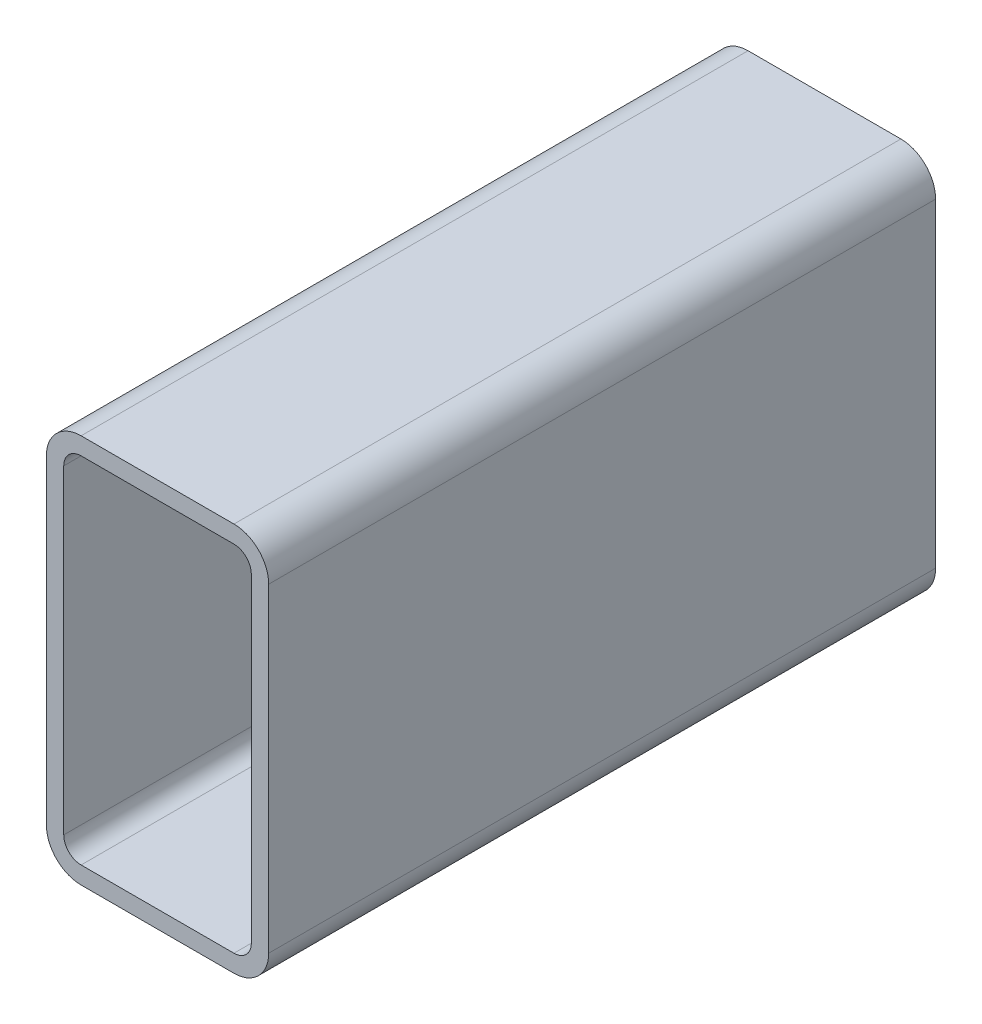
ISO-10303-21;
HEADER;
FILE_DESCRIPTION(('STEP AP214'),'2;1');
FILE_NAME('part.step','',(''),(''),'','','');
FILE_SCHEMA(('AUTOMOTIVE_DESIGN { 1 0 10303 214 1 1 1 1 }'));
ENDSEC;
DATA;
#1=APPLICATION_CONTEXT('core data for automotive mechanical design processes');
#2=APPLICATION_PROTOCOL_DEFINITION('international standard','automotive_design',2000,#1);
#3=PRODUCT_CONTEXT('',#1,'mechanical');
#4=PRODUCT('Part','Part','',(#3));
#5=PRODUCT_RELATED_PRODUCT_CATEGORY('part','',(#4));
#6=PRODUCT_DEFINITION_FORMATION('','',#4);
#7=PRODUCT_DEFINITION_CONTEXT('part definition',#1,'design');
#8=PRODUCT_DEFINITION('design','',#6,#7);
#9=PRODUCT_DEFINITION_SHAPE('','',#8);
#10=(LENGTH_UNIT() NAMED_UNIT(*) SI_UNIT(.MILLI.,.METRE.));
#11=(NAMED_UNIT(*) PLANE_ANGLE_UNIT() SI_UNIT($,.RADIAN.));
#12=(NAMED_UNIT(*) SI_UNIT($,.STERADIAN.) SOLID_ANGLE_UNIT());
#13=UNCERTAINTY_MEASURE_WITH_UNIT(LENGTH_MEASURE(1.E-05),#10,'distance_accuracy_value','');
#14=(GEOMETRIC_REPRESENTATION_CONTEXT(3) GLOBAL_UNCERTAINTY_ASSIGNED_CONTEXT((#13)) GLOBAL_UNIT_ASSIGNED_CONTEXT((#10,
#11,#12)) REPRESENTATION_CONTEXT('',''));
#15=CARTESIAN_POINT('',(0.,0.,0.));
#16=DIRECTION('',(0.,0.,1.));
#17=DIRECTION('',(1.,0.,0.));
#18=AXIS2_PLACEMENT_3D('',#15,#16,#17);
#19=CARTESIAN_POINT('',(17.5501778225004,163.914039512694,304.8));
#20=DIRECTION('',(0.,0.,1.));
#21=DIRECTION('',(1.,0.,0.));
#22=AXIS2_PLACEMENT_3D('',#19,#20,#21);
#23=PLANE('',#22);
#24=CARTESIAN_POINT('',(17.5501778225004,163.914039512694,304.8));
#25=DIRECTION('',(0.,0.,1.));
#26=DIRECTION('',(1.,0.,0.));
#27=AXIS2_PLACEMENT_3D('',#24,#25,#26);
#28=CIRCLE('',#27,15.875);
#29=CARTESIAN_POINT('',(17.5501778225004,179.789039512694,304.8));
#30=VERTEX_POINT('',#29);
#31=CARTESIAN_POINT('',(1.67517782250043,163.914039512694,304.8));
#32=VERTEX_POINT('',#31);
#33=EDGE_CURVE('E211',#30,#32,#28,.T.);
#34=ORIENTED_EDGE('',*,*,#33,.T.);
#35=DIRECTION('',(0.,-1.,0.));
#36=VECTOR('',#35,1.);
#37=CARTESIAN_POINT('',(1.67517782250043,17.8640395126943,304.8));
#38=LINE('',#37,#36);
#39=CARTESIAN_POINT('',(1.67517782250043,17.8640395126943,304.8));
#40=VERTEX_POINT('',#39);
#41=EDGE_CURVE('E214',#32,#40,#38,.T.);
#42=ORIENTED_EDGE('',*,*,#41,.T.);
#43=CARTESIAN_POINT('',(17.5501778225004,17.8640395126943,304.8));
#44=DIRECTION('',(0.,0.,1.));
#45=DIRECTION('',(1.,0.,0.));
#46=AXIS2_PLACEMENT_3D('',#43,#44,#45);
#47=CIRCLE('',#46,15.875);
#48=CARTESIAN_POINT('',(17.5501778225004,1.98903951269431,304.8));
#49=VERTEX_POINT('',#48);
#50=EDGE_CURVE('E217',#40,#49,#47,.T.);
#51=ORIENTED_EDGE('',*,*,#50,.T.);
#52=DIRECTION('',(1.,0.,0.));
#53=VECTOR('',#52,1.);
#54=CARTESIAN_POINT('',(87.4001778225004,1.98903951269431,304.8));
#55=LINE('',#54,#53);
#56=CARTESIAN_POINT('',(87.4001778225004,1.98903951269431,304.8));
#57=VERTEX_POINT('',#56);
#58=EDGE_CURVE('E219',#49,#57,#55,.T.);
#59=ORIENTED_EDGE('',*,*,#58,.T.);
#60=CARTESIAN_POINT('',(87.4001778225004,17.8640395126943,304.8));
#61=DIRECTION('',(0.,0.,1.));
#62=DIRECTION('',(1.,0.,0.));
#63=AXIS2_PLACEMENT_3D('',#60,#61,#62);
#64=CIRCLE('',#63,15.875);
#65=CARTESIAN_POINT('',(103.2751778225,17.8640395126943,304.8));
#66=VERTEX_POINT('',#65);
#67=EDGE_CURVE('E221',#57,#66,#64,.T.);
#68=ORIENTED_EDGE('',*,*,#67,.T.);
#69=DIRECTION('',(0.,1.,0.));
#70=VECTOR('',#69,1.);
#71=CARTESIAN_POINT('',(103.2751778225,163.914039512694,304.8));
#72=LINE('',#71,#70);
#73=CARTESIAN_POINT('',(103.2751778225,163.914039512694,304.8));
#74=VERTEX_POINT('',#73);
#75=EDGE_CURVE('E223',#66,#74,#72,.T.);
#76=ORIENTED_EDGE('',*,*,#75,.T.);
#77=CARTESIAN_POINT('',(87.4001778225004,163.914039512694,304.8));
#78=DIRECTION('',(0.,0.,1.));
#79=DIRECTION('',(1.,0.,0.));
#80=AXIS2_PLACEMENT_3D('',#77,#78,#79);
#81=CIRCLE('',#80,15.875);
#82=CARTESIAN_POINT('',(87.4001778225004,179.789039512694,304.8));
#83=VERTEX_POINT('',#82);
#84=EDGE_CURVE('E225',#74,#83,#81,.T.);
#85=ORIENTED_EDGE('',*,*,#84,.T.);
#86=DIRECTION('',(-1.,0.,0.));
#87=VECTOR('',#86,1.);
#88=CARTESIAN_POINT('',(17.5501778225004,179.789039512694,304.8));
#89=LINE('',#88,#87);
#90=EDGE_CURVE('E227',#83,#30,#89,.T.);
#91=ORIENTED_EDGE('',*,*,#90,.T.);
#92=EDGE_LOOP('',(#34,#42,#51,#59,#68,#76,#85,#91));
#93=FACE_BOUND('',#92,.T.);
#94=DIRECTION('',(0.,-1.,0.));
#95=VECTOR('',#94,1.);
#96=CARTESIAN_POINT('',(9.61267782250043,17.8640395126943,304.8));
#97=LINE('',#96,#95);
#98=CARTESIAN_POINT('',(9.61267782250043,163.914039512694,304.8));
#99=VERTEX_POINT('',#98);
#100=CARTESIAN_POINT('',(9.61267782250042,17.8640395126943,304.8));
#101=VERTEX_POINT('',#100);
#102=EDGE_CURVE('E154',#99,#101,#97,.T.);
#103=ORIENTED_EDGE('',*,*,#102,.F.);
#104=CARTESIAN_POINT('',(17.5501778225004,163.914039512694,304.8));
#105=DIRECTION('',(0.,0.,1.));
#106=DIRECTION('',(1.,0.,0.));
#107=AXIS2_PLACEMENT_3D('',#104,#105,#106);
#108=CIRCLE('',#107,7.93750000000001);
#109=CARTESIAN_POINT('',(17.5501778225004,171.851539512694,304.8));
#110=VERTEX_POINT('',#109);
#111=EDGE_CURVE('E146',#110,#99,#108,.T.);
#112=ORIENTED_EDGE('',*,*,#111,.F.);
#113=DIRECTION('',(-1.,0.,0.));
#114=VECTOR('',#113,1.);
#115=CARTESIAN_POINT('',(17.5501778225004,171.851539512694,304.8));
#116=LINE('',#115,#114);
#117=CARTESIAN_POINT('',(87.4001778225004,171.851539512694,304.8));
#118=VERTEX_POINT('',#117);
#119=EDGE_CURVE('E179',#118,#110,#116,.T.);
#120=ORIENTED_EDGE('',*,*,#119,.F.);
#121=CARTESIAN_POINT('',(87.4001778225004,163.914039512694,304.8));
#122=DIRECTION('',(0.,0.,1.));
#123=DIRECTION('',(1.,0.,0.));
#124=AXIS2_PLACEMENT_3D('',#121,#122,#123);
#125=CIRCLE('',#124,7.93750000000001);
#126=CARTESIAN_POINT('',(95.3376778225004,163.914039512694,304.8));
#127=VERTEX_POINT('',#126);
#128=EDGE_CURVE('E177',#127,#118,#125,.T.);
#129=ORIENTED_EDGE('',*,*,#128,.F.);
#130=DIRECTION('',(0.,1.,0.));
#131=VECTOR('',#130,1.);
#132=CARTESIAN_POINT('',(95.3376778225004,163.914039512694,304.8));
#133=LINE('',#132,#131);
#134=CARTESIAN_POINT('',(95.3376778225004,17.8640395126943,304.8));
#135=VERTEX_POINT('',#134);
#136=EDGE_CURVE('E175',#135,#127,#133,.T.);
#137=ORIENTED_EDGE('',*,*,#136,.F.);
#138=CARTESIAN_POINT('',(87.4001778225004,17.8640395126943,304.8));
#139=DIRECTION('',(0.,0.,1.));
#140=DIRECTION('',(1.,0.,0.));
#141=AXIS2_PLACEMENT_3D('',#138,#139,#140);
#142=CIRCLE('',#141,7.9375);
#143=CARTESIAN_POINT('',(87.4001778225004,9.92653951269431,304.8));
#144=VERTEX_POINT('',#143);
#145=EDGE_CURVE('E173',#144,#135,#142,.T.);
#146=ORIENTED_EDGE('',*,*,#145,.F.);
#147=DIRECTION('',(1.,0.,0.));
#148=VECTOR('',#147,1.);
#149=CARTESIAN_POINT('',(87.4001778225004,9.92653951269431,304.8));
#150=LINE('',#149,#148);
#151=CARTESIAN_POINT('',(17.5501778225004,9.92653951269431,304.8));
#152=VERTEX_POINT('',#151);
#153=EDGE_CURVE('E169',#152,#144,#150,.T.);
#154=ORIENTED_EDGE('',*,*,#153,.F.);
#155=CARTESIAN_POINT('',(17.5501778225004,17.8640395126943,304.8));
#156=DIRECTION('',(0.,0.,1.));
#157=DIRECTION('',(1.,0.,0.));
#158=AXIS2_PLACEMENT_3D('',#155,#156,#157);
#159=CIRCLE('',#158,7.9375);
#160=EDGE_CURVE('E167',#101,#152,#159,.T.);
#161=ORIENTED_EDGE('',*,*,#160,.F.);
#162=EDGE_LOOP('',(#103,#112,#120,#129,#137,#146,#154,#161));
#163=FACE_BOUND('',#162,.T.);
#164=ADVANCED_FACE('F33',(#93,#163),#23,.T.);
#165=CARTESIAN_POINT('',(17.5501778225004,163.914039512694,0.));
#166=DIRECTION('',(0.,0.,1.));
#167=DIRECTION('',(1.,0.,0.));
#168=AXIS2_PLACEMENT_3D('',#165,#166,#167);
#169=PLANE('',#168);
#170=CARTESIAN_POINT('',(17.5501778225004,163.914039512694,0.));
#171=DIRECTION('',(0.,0.,1.));
#172=DIRECTION('',(1.,0.,0.));
#173=AXIS2_PLACEMENT_3D('',#170,#171,#172);
#174=CIRCLE('',#173,15.875);
#175=CARTESIAN_POINT('',(17.5501778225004,179.789039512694,0.));
#176=VERTEX_POINT('',#175);
#177=CARTESIAN_POINT('',(1.67517782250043,163.914039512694,0.));
#178=VERTEX_POINT('',#177);
#179=EDGE_CURVE('E162',#176,#178,#174,.T.);
#180=ORIENTED_EDGE('',*,*,#179,.F.);
#181=DIRECTION('',(-1.,0.,0.));
#182=VECTOR('',#181,1.);
#183=CARTESIAN_POINT('',(17.5501778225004,179.789039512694,0.));
#184=LINE('',#183,#182);
#185=CARTESIAN_POINT('',(87.4001778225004,179.789039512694,0.));
#186=VERTEX_POINT('',#185);
#187=EDGE_CURVE('E215',#186,#176,#184,.T.);
#188=ORIENTED_EDGE('',*,*,#187,.F.);
#189=CARTESIAN_POINT('',(87.4001778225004,163.914039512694,0.));
#190=DIRECTION('',(0.,0.,1.));
#191=DIRECTION('',(1.,0.,0.));
#192=AXIS2_PLACEMENT_3D('',#189,#190,#191);
#193=CIRCLE('',#192,15.875);
#194=CARTESIAN_POINT('',(103.2751778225,163.914039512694,0.));
#195=VERTEX_POINT('',#194);
#196=EDGE_CURVE('E242',#195,#186,#193,.T.);
#197=ORIENTED_EDGE('',*,*,#196,.F.);
#198=DIRECTION('',(0.,1.,0.));
#199=VECTOR('',#198,1.);
#200=CARTESIAN_POINT('',(103.2751778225,163.914039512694,0.));
#201=LINE('',#200,#199);
#202=CARTESIAN_POINT('',(103.2751778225,17.8640395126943,0.));
#203=VERTEX_POINT('',#202);
#204=EDGE_CURVE('E240',#203,#195,#201,.T.);
#205=ORIENTED_EDGE('',*,*,#204,.F.);
#206=CARTESIAN_POINT('',(87.4001778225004,17.8640395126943,0.));
#207=DIRECTION('',(0.,0.,1.));
#208=DIRECTION('',(1.,0.,0.));
#209=AXIS2_PLACEMENT_3D('',#206,#207,#208);
#210=CIRCLE('',#209,15.875);
#211=CARTESIAN_POINT('',(87.4001778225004,1.98903951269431,0.));
#212=VERTEX_POINT('',#211);
#213=EDGE_CURVE('E238',#212,#203,#210,.T.);
#214=ORIENTED_EDGE('',*,*,#213,.F.);
#215=DIRECTION('',(1.,0.,0.));
#216=VECTOR('',#215,1.);
#217=CARTESIAN_POINT('',(87.4001778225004,1.98903951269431,0.));
#218=LINE('',#217,#216);
#219=CARTESIAN_POINT('',(17.5501778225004,1.98903951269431,0.));
#220=VERTEX_POINT('',#219);
#221=EDGE_CURVE('E236',#220,#212,#218,.T.);
#222=ORIENTED_EDGE('',*,*,#221,.F.);
#223=CARTESIAN_POINT('',(17.5501778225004,17.8640395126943,0.));
#224=DIRECTION('',(0.,0.,1.));
#225=DIRECTION('',(1.,0.,0.));
#226=AXIS2_PLACEMENT_3D('',#223,#224,#225);
#227=CIRCLE('',#226,15.875);
#228=CARTESIAN_POINT('',(1.67517782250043,17.8640395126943,0.));
#229=VERTEX_POINT('',#228);
#230=EDGE_CURVE('E234',#229,#220,#227,.T.);
#231=ORIENTED_EDGE('',*,*,#230,.F.);
#232=DIRECTION('',(0.,-1.,0.));
#233=VECTOR('',#232,1.);
#234=CARTESIAN_POINT('',(1.67517782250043,17.8640395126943,0.));
#235=LINE('',#234,#233);
#236=EDGE_CURVE('E232',#178,#229,#235,.T.);
#237=ORIENTED_EDGE('',*,*,#236,.F.);
#238=EDGE_LOOP('',(#180,#188,#197,#205,#214,#222,#231,#237));
#239=FACE_BOUND('',#238,.T.);
#240=CARTESIAN_POINT('',(17.5501778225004,163.914039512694,0.));
#241=DIRECTION('',(0.,0.,1.));
#242=DIRECTION('',(1.,0.,0.));
#243=AXIS2_PLACEMENT_3D('',#240,#241,#242);
#244=CIRCLE('',#243,7.93750000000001);
#245=CARTESIAN_POINT('',(17.5501778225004,171.851539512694,0.));
#246=VERTEX_POINT('',#245);
#247=CARTESIAN_POINT('',(9.61267782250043,163.914039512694,0.));
#248=VERTEX_POINT('',#247);
#249=EDGE_CURVE('E56',#246,#248,#244,.T.);
#250=ORIENTED_EDGE('',*,*,#249,.T.);
#251=DIRECTION('',(0.,-1.,0.));
#252=VECTOR('',#251,1.);
#253=CARTESIAN_POINT('',(9.61267782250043,17.8640395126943,0.));
#254=LINE('',#253,#252);
#255=CARTESIAN_POINT('',(9.61267782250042,17.8640395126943,0.));
#256=VERTEX_POINT('',#255);
#257=EDGE_CURVE('E161',#248,#256,#254,.T.);
#258=ORIENTED_EDGE('',*,*,#257,.T.);
#259=CARTESIAN_POINT('',(17.5501778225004,17.8640395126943,0.));
#260=DIRECTION('',(0.,0.,1.));
#261=DIRECTION('',(1.,0.,0.));
#262=AXIS2_PLACEMENT_3D('',#259,#260,#261);
#263=CIRCLE('',#262,7.9375);
#264=CARTESIAN_POINT('',(17.5501778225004,9.92653951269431,0.));
#265=VERTEX_POINT('',#264);
#266=EDGE_CURVE('E183',#256,#265,#263,.T.);
#267=ORIENTED_EDGE('',*,*,#266,.T.);
#268=DIRECTION('',(1.,0.,0.));
#269=VECTOR('',#268,1.);
#270=CARTESIAN_POINT('',(87.4001778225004,9.92653951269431,0.));
#271=LINE('',#270,#269);
#272=CARTESIAN_POINT('',(87.4001778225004,9.92653951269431,0.));
#273=VERTEX_POINT('',#272);
#274=EDGE_CURVE('E186',#265,#273,#271,.T.);
#275=ORIENTED_EDGE('',*,*,#274,.T.);
#276=CARTESIAN_POINT('',(87.4001778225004,17.8640395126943,0.));
#277=DIRECTION('',(0.,0.,1.));
#278=DIRECTION('',(1.,0.,0.));
#279=AXIS2_PLACEMENT_3D('',#276,#277,#278);
#280=CIRCLE('',#279,7.9375);
#281=CARTESIAN_POINT('',(95.3376778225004,17.8640395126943,0.));
#282=VERTEX_POINT('',#281);
#283=EDGE_CURVE('E189',#273,#282,#280,.T.);
#284=ORIENTED_EDGE('',*,*,#283,.T.);
#285=DIRECTION('',(0.,1.,0.));
#286=VECTOR('',#285,1.);
#287=CARTESIAN_POINT('',(95.3376778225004,163.914039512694,0.));
#288=LINE('',#287,#286);
#289=CARTESIAN_POINT('',(95.3376778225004,163.914039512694,0.));
#290=VERTEX_POINT('',#289);
#291=EDGE_CURVE('E192',#282,#290,#288,.T.);
#292=ORIENTED_EDGE('',*,*,#291,.T.);
#293=CARTESIAN_POINT('',(87.4001778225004,163.914039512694,0.));
#294=DIRECTION('',(0.,0.,1.));
#295=DIRECTION('',(1.,0.,0.));
#296=AXIS2_PLACEMENT_3D('',#293,#294,#295);
#297=CIRCLE('',#296,7.93750000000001);
#298=CARTESIAN_POINT('',(87.4001778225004,171.851539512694,0.));
#299=VERTEX_POINT('',#298);
#300=EDGE_CURVE('E195',#290,#299,#297,.T.);
#301=ORIENTED_EDGE('',*,*,#300,.T.);
#302=DIRECTION('',(-1.,0.,0.));
#303=VECTOR('',#302,1.);
#304=CARTESIAN_POINT('',(17.5501778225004,171.851539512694,0.));
#305=LINE('',#304,#303);
#306=EDGE_CURVE('E155',#299,#246,#305,.T.);
#307=ORIENTED_EDGE('',*,*,#306,.T.);
#308=EDGE_LOOP('',(#250,#258,#267,#275,#284,#292,#301,#307));
#309=FACE_BOUND('',#308,.T.);
#310=ADVANCED_FACE('F272',(#239,#309),#169,.F.);
#311=CARTESIAN_POINT('',(17.5501778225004,163.914039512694,304.8));
#312=DIRECTION('',(0.,0.,-1.));
#313=DIRECTION('',(-1.,0.,0.));
#314=AXIS2_PLACEMENT_3D('',#311,#312,#313);
#315=CYLINDRICAL_SURFACE('',#314,15.875);
#316=ORIENTED_EDGE('',*,*,#179,.T.);
#317=DIRECTION('',(0.,0.,-1.));
#318=VECTOR('',#317,1.);
#319=CARTESIAN_POINT('',(1.67517782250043,163.914039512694,304.8));
#320=LINE('',#319,#318);
#321=EDGE_CURVE('E11',#32,#178,#320,.T.);
#322=ORIENTED_EDGE('',*,*,#321,.F.);
#323=ORIENTED_EDGE('',*,*,#33,.F.);
#324=DIRECTION('',(0.,0.,-1.));
#325=VECTOR('',#324,1.);
#326=CARTESIAN_POINT('',(17.5501778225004,179.789039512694,304.8));
#327=LINE('',#326,#325);
#328=EDGE_CURVE('E229',#30,#176,#327,.T.);
#329=ORIENTED_EDGE('',*,*,#328,.T.);
#330=EDGE_LOOP('',(#316,#322,#323,#329));
#331=FACE_BOUND('',#330,.T.);
#332=ADVANCED_FACE('F35',(#331),#315,.T.);
#333=CARTESIAN_POINT('',(1.67517782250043,17.8640395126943,304.8));
#334=DIRECTION('',(1.,0.,0.));
#335=DIRECTION('',(0.,0.,-1.));
#336=AXIS2_PLACEMENT_3D('',#333,#334,#335);
#337=PLANE('',#336);
#338=ORIENTED_EDGE('',*,*,#236,.T.);
#339=DIRECTION('',(0.,0.,-1.));
#340=VECTOR('',#339,1.);
#341=CARTESIAN_POINT('',(1.67517782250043,17.8640395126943,304.8));
#342=LINE('',#341,#340);
#343=EDGE_CURVE('E41',#40,#229,#342,.T.);
#344=ORIENTED_EDGE('',*,*,#343,.F.);
#345=ORIENTED_EDGE('',*,*,#41,.F.);
#346=ORIENTED_EDGE('',*,*,#321,.T.);
#347=EDGE_LOOP('',(#338,#344,#345,#346));
#348=FACE_BOUND('',#347,.T.);
#349=ADVANCED_FACE('F289',(#348),#337,.F.);
#350=CARTESIAN_POINT('',(17.5501778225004,17.8640395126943,304.8));
#351=DIRECTION('',(0.,0.,-1.));
#352=DIRECTION('',(-1.,0.,0.));
#353=AXIS2_PLACEMENT_3D('',#350,#351,#352);
#354=CYLINDRICAL_SURFACE('',#353,15.875);
#355=ORIENTED_EDGE('',*,*,#230,.T.);
#356=DIRECTION('',(0.,0.,-1.));
#357=VECTOR('',#356,1.);
#358=CARTESIAN_POINT('',(17.5501778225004,1.98903951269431,304.8));
#359=LINE('',#358,#357);
#360=EDGE_CURVE('E259',#49,#220,#359,.T.);
#361=ORIENTED_EDGE('',*,*,#360,.F.);
#362=ORIENTED_EDGE('',*,*,#50,.F.);
#363=ORIENTED_EDGE('',*,*,#343,.T.);
#364=EDGE_LOOP('',(#355,#361,#362,#363));
#365=FACE_BOUND('',#364,.T.);
#366=ADVANCED_FACE('F266',(#365),#354,.T.);
#367=CARTESIAN_POINT('',(87.4001778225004,1.98903951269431,304.8));
#368=DIRECTION('',(0.,1.,0.));
#369=DIRECTION('',(0.,0.,1.));
#370=AXIS2_PLACEMENT_3D('',#367,#368,#369);
#371=PLANE('',#370);
#372=ORIENTED_EDGE('',*,*,#221,.T.);
#373=DIRECTION('',(0.,0.,-1.));
#374=VECTOR('',#373,1.);
#375=CARTESIAN_POINT('',(87.4001778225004,1.98903951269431,304.8));
#376=LINE('',#375,#374);
#377=EDGE_CURVE('E256',#57,#212,#376,.T.);
#378=ORIENTED_EDGE('',*,*,#377,.F.);
#379=ORIENTED_EDGE('',*,*,#58,.F.);
#380=ORIENTED_EDGE('',*,*,#360,.T.);
#381=EDGE_LOOP('',(#372,#378,#379,#380));
#382=FACE_BOUND('',#381,.T.);
#383=ADVANCED_FACE('F278',(#382),#371,.F.);
#384=CARTESIAN_POINT('',(87.4001778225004,17.8640395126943,304.8));
#385=DIRECTION('',(0.,0.,-1.));
#386=DIRECTION('',(-1.,0.,0.));
#387=AXIS2_PLACEMENT_3D('',#384,#385,#386);
#388=CYLINDRICAL_SURFACE('',#387,15.875);
#389=ORIENTED_EDGE('',*,*,#213,.T.);
#390=DIRECTION('',(0.,0.,-1.));
#391=VECTOR('',#390,1.);
#392=CARTESIAN_POINT('',(103.2751778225,17.8640395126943,304.8));
#393=LINE('',#392,#391);
#394=EDGE_CURVE('E253',#66,#203,#393,.T.);
#395=ORIENTED_EDGE('',*,*,#394,.F.);
#396=ORIENTED_EDGE('',*,*,#67,.F.);
#397=ORIENTED_EDGE('',*,*,#377,.T.);
#398=EDGE_LOOP('',(#389,#395,#396,#397));
#399=FACE_BOUND('',#398,.T.);
#400=ADVANCED_FACE('F282',(#399),#388,.T.);
#401=CARTESIAN_POINT('',(103.2751778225,163.914039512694,304.8));
#402=DIRECTION('',(-1.,0.,0.));
#403=DIRECTION('',(0.,0.,1.));
#404=AXIS2_PLACEMENT_3D('',#401,#402,#403);
#405=PLANE('',#404);
#406=ORIENTED_EDGE('',*,*,#204,.T.);
#407=DIRECTION('',(0.,0.,-1.));
#408=VECTOR('',#407,1.);
#409=CARTESIAN_POINT('',(103.2751778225,163.914039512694,304.8));
#410=LINE('',#409,#408);
#411=EDGE_CURVE('E250',#74,#195,#410,.T.);
#412=ORIENTED_EDGE('',*,*,#411,.F.);
#413=ORIENTED_EDGE('',*,*,#75,.F.);
#414=ORIENTED_EDGE('',*,*,#394,.T.);
#415=EDGE_LOOP('',(#406,#412,#413,#414));
#416=FACE_BOUND('',#415,.T.);
#417=ADVANCED_FACE('F302',(#416),#405,.F.);
#418=CARTESIAN_POINT('',(87.4001778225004,163.914039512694,304.8));
#419=DIRECTION('',(0.,0.,-1.));
#420=DIRECTION('',(-1.,0.,0.));
#421=AXIS2_PLACEMENT_3D('',#418,#419,#420);
#422=CYLINDRICAL_SURFACE('',#421,15.875);
#423=ORIENTED_EDGE('',*,*,#196,.T.);
#424=DIRECTION('',(0.,0.,-1.));
#425=VECTOR('',#424,1.);
#426=CARTESIAN_POINT('',(87.4001778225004,179.789039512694,304.8));
#427=LINE('',#426,#425);
#428=EDGE_CURVE('E247',#83,#186,#427,.T.);
#429=ORIENTED_EDGE('',*,*,#428,.F.);
#430=ORIENTED_EDGE('',*,*,#84,.F.);
#431=ORIENTED_EDGE('',*,*,#411,.T.);
#432=EDGE_LOOP('',(#423,#429,#430,#431));
#433=FACE_BOUND('',#432,.T.);
#434=ADVANCED_FACE('F300',(#433),#422,.T.);
#435=CARTESIAN_POINT('',(17.5501778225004,179.789039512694,304.8));
#436=DIRECTION('',(0.,-1.,0.));
#437=DIRECTION('',(0.,0.,-1.));
#438=AXIS2_PLACEMENT_3D('',#435,#436,#437);
#439=PLANE('',#438);
#440=ORIENTED_EDGE('',*,*,#187,.T.);
#441=ORIENTED_EDGE('',*,*,#328,.F.);
#442=ORIENTED_EDGE('',*,*,#90,.F.);
#443=ORIENTED_EDGE('',*,*,#428,.T.);
#444=EDGE_LOOP('',(#440,#441,#442,#443));
#445=FACE_BOUND('',#444,.T.);
#446=ADVANCED_FACE('F295',(#445),#439,.F.);
#447=CARTESIAN_POINT('',(17.5501778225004,163.914039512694,304.8));
#448=DIRECTION('',(0.,0.,-1.));
#449=DIRECTION('',(-1.,0.,0.));
#450=AXIS2_PLACEMENT_3D('',#447,#448,#449);
#451=CYLINDRICAL_SURFACE('',#450,7.93750000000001);
#452=ORIENTED_EDGE('',*,*,#249,.F.);
#453=DIRECTION('',(0.,0.,-1.));
#454=VECTOR('',#453,1.);
#455=CARTESIAN_POINT('',(17.5501778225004,171.851539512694,304.8));
#456=LINE('',#455,#454);
#457=EDGE_CURVE('E150',#110,#246,#456,.T.);
#458=ORIENTED_EDGE('',*,*,#457,.F.);
#459=ORIENTED_EDGE('',*,*,#111,.T.);
#460=DIRECTION('',(0.,0.,-1.));
#461=VECTOR('',#460,1.);
#462=CARTESIAN_POINT('',(9.61267782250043,163.914039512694,304.8));
#463=LINE('',#462,#461);
#464=EDGE_CURVE('E149',#99,#248,#463,.T.);
#465=ORIENTED_EDGE('',*,*,#464,.T.);
#466=EDGE_LOOP('',(#452,#458,#459,#465));
#467=FACE_BOUND('',#466,.T.);
#468=ADVANCED_FACE('F148',(#467),#451,.F.);
#469=CARTESIAN_POINT('',(9.61267782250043,17.8640395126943,304.8));
#470=DIRECTION('',(1.,0.,0.));
#471=DIRECTION('',(0.,0.,-1.));
#472=AXIS2_PLACEMENT_3D('',#469,#470,#471);
#473=PLANE('',#472);
#474=ORIENTED_EDGE('',*,*,#257,.F.);
#475=ORIENTED_EDGE('',*,*,#464,.F.);
#476=ORIENTED_EDGE('',*,*,#102,.T.);
#477=DIRECTION('',(0.,0.,-1.));
#478=VECTOR('',#477,1.);
#479=CARTESIAN_POINT('',(9.61267782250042,17.8640395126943,304.8));
#480=LINE('',#479,#478);
#481=EDGE_CURVE('E163',#101,#256,#480,.T.);
#482=ORIENTED_EDGE('',*,*,#481,.T.);
#483=EDGE_LOOP('',(#474,#475,#476,#482));
#484=FACE_BOUND('',#483,.T.);
#485=ADVANCED_FACE('F158',(#484),#473,.T.);
#486=CARTESIAN_POINT('',(17.5501778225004,17.8640395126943,304.8));
#487=DIRECTION('',(0.,0.,-1.));
#488=DIRECTION('',(-1.,0.,0.));
#489=AXIS2_PLACEMENT_3D('',#486,#487,#488);
#490=CYLINDRICAL_SURFACE('',#489,7.9375);
#491=ORIENTED_EDGE('',*,*,#266,.F.);
#492=ORIENTED_EDGE('',*,*,#481,.F.);
#493=ORIENTED_EDGE('',*,*,#160,.T.);
#494=DIRECTION('',(0.,0.,-1.));
#495=VECTOR('',#494,1.);
#496=CARTESIAN_POINT('',(17.5501778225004,9.92653951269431,304.8));
#497=LINE('',#496,#495);
#498=EDGE_CURVE('E208',#152,#265,#497,.T.);
#499=ORIENTED_EDGE('',*,*,#498,.T.);
#500=EDGE_LOOP('',(#491,#492,#493,#499));
#501=FACE_BOUND('',#500,.T.);
#502=ADVANCED_FACE('F327',(#501),#490,.F.);
#503=CARTESIAN_POINT('',(87.4001778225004,9.92653951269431,304.8));
#504=DIRECTION('',(0.,1.,0.));
#505=DIRECTION('',(0.,0.,1.));
#506=AXIS2_PLACEMENT_3D('',#503,#504,#505);
#507=PLANE('',#506);
#508=ORIENTED_EDGE('',*,*,#274,.F.);
#509=ORIENTED_EDGE('',*,*,#498,.F.);
#510=ORIENTED_EDGE('',*,*,#153,.T.);
#511=DIRECTION('',(0.,0.,-1.));
#512=VECTOR('',#511,1.);
#513=CARTESIAN_POINT('',(87.4001778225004,9.92653951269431,304.8));
#514=LINE('',#513,#512);
#515=EDGE_CURVE('E206',#144,#273,#514,.T.);
#516=ORIENTED_EDGE('',*,*,#515,.T.);
#517=EDGE_LOOP('',(#508,#509,#510,#516));
#518=FACE_BOUND('',#517,.T.);
#519=ADVANCED_FACE('F331',(#518),#507,.T.);
#520=CARTESIAN_POINT('',(87.4001778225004,17.8640395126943,304.8));
#521=DIRECTION('',(0.,0.,-1.));
#522=DIRECTION('',(-1.,0.,0.));
#523=AXIS2_PLACEMENT_3D('',#520,#521,#522);
#524=CYLINDRICAL_SURFACE('',#523,7.9375);
#525=ORIENTED_EDGE('',*,*,#283,.F.);
#526=ORIENTED_EDGE('',*,*,#515,.F.);
#527=ORIENTED_EDGE('',*,*,#145,.T.);
#528=DIRECTION('',(0.,0.,-1.));
#529=VECTOR('',#528,1.);
#530=CARTESIAN_POINT('',(95.3376778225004,17.8640395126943,304.8));
#531=LINE('',#530,#529);
#532=EDGE_CURVE('E204',#135,#282,#531,.T.);
#533=ORIENTED_EDGE('',*,*,#532,.T.);
#534=EDGE_LOOP('',(#525,#526,#527,#533));
#535=FACE_BOUND('',#534,.T.);
#536=ADVANCED_FACE('F337',(#535),#524,.F.);
#537=CARTESIAN_POINT('',(95.3376778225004,163.914039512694,304.8));
#538=DIRECTION('',(-1.,0.,0.));
#539=DIRECTION('',(0.,0.,1.));
#540=AXIS2_PLACEMENT_3D('',#537,#538,#539);
#541=PLANE('',#540);
#542=ORIENTED_EDGE('',*,*,#291,.F.);
#543=ORIENTED_EDGE('',*,*,#532,.F.);
#544=ORIENTED_EDGE('',*,*,#136,.T.);
#545=DIRECTION('',(0.,0.,-1.));
#546=VECTOR('',#545,1.);
#547=CARTESIAN_POINT('',(95.3376778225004,163.914039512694,304.8));
#548=LINE('',#547,#546);
#549=EDGE_CURVE('E202',#127,#290,#548,.T.);
#550=ORIENTED_EDGE('',*,*,#549,.T.);
#551=EDGE_LOOP('',(#542,#543,#544,#550));
#552=FACE_BOUND('',#551,.T.);
#553=ADVANCED_FACE('F341',(#552),#541,.T.);
#554=CARTESIAN_POINT('',(87.4001778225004,163.914039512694,304.8));
#555=DIRECTION('',(0.,0.,-1.));
#556=DIRECTION('',(-1.,0.,0.));
#557=AXIS2_PLACEMENT_3D('',#554,#555,#556);
#558=CYLINDRICAL_SURFACE('',#557,7.93750000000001);
#559=ORIENTED_EDGE('',*,*,#300,.F.);
#560=ORIENTED_EDGE('',*,*,#549,.F.);
#561=ORIENTED_EDGE('',*,*,#128,.T.);
#562=DIRECTION('',(0.,0.,-1.));
#563=VECTOR('',#562,1.);
#564=CARTESIAN_POINT('',(87.4001778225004,171.851539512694,304.8));
#565=LINE('',#564,#563);
#566=EDGE_CURVE('E48',#118,#299,#565,.T.);
#567=ORIENTED_EDGE('',*,*,#566,.T.);
#568=EDGE_LOOP('',(#559,#560,#561,#567));
#569=FACE_BOUND('',#568,.T.);
#570=ADVANCED_FACE('F345',(#569),#558,.F.);
#571=CARTESIAN_POINT('',(17.5501778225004,171.851539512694,304.8));
#572=DIRECTION('',(0.,-1.,0.));
#573=DIRECTION('',(0.,0.,-1.));
#574=AXIS2_PLACEMENT_3D('',#571,#572,#573);
#575=PLANE('',#574);
#576=ORIENTED_EDGE('',*,*,#306,.F.);
#577=ORIENTED_EDGE('',*,*,#566,.F.);
#578=ORIENTED_EDGE('',*,*,#119,.T.);
#579=ORIENTED_EDGE('',*,*,#457,.T.);
#580=EDGE_LOOP('',(#576,#577,#578,#579));
#581=FACE_BOUND('',#580,.T.);
#582=ADVANCED_FACE('F349',(#581),#575,.T.);
#583=CLOSED_SHELL('',(#164,#310,#332,#349,#366,#383,#400,#417,#434,#446,#468,#485,#502,#519,
#536,#553,#570,#582));
#584=MANIFOLD_SOLID_BREP('B2',#583);
#585=ADVANCED_BREP_SHAPE_REPRESENTATION('',(#18,#584),#14);
#586=SHAPE_DEFINITION_REPRESENTATION(#9,#585);
ENDSEC;
END-ISO-10303-21;
